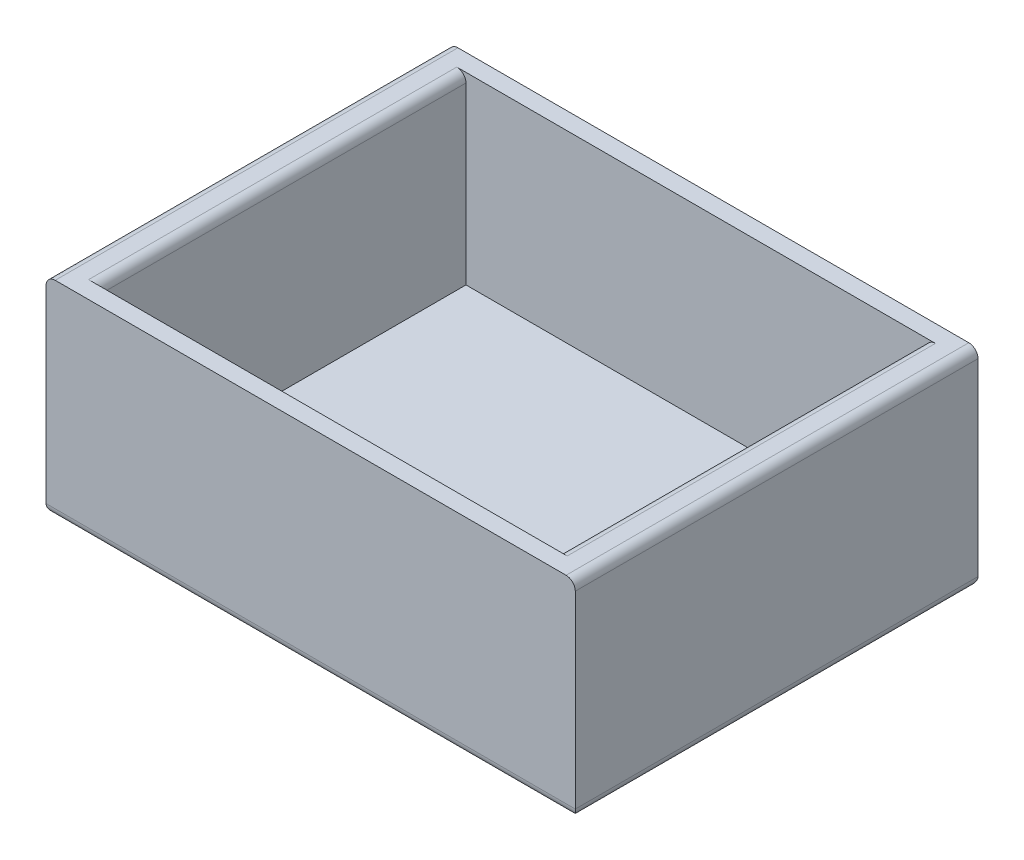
from build123d import *

# Parameters (mm, degrees)
SKETCH1_W           = 146.05
SKETCH1_H           = 111.125
BOSS_EXTRUDE1_DEPTH = 57.15
SKETCH2_W           = 127
SKETCH2_H           = 101.6
CUT_EXTRUDE1_DEPTH  = 50.8
FILLET1_R           = 2.54


with BuildPart() as part:
    # Sketch1 → Boss-Extrude1 (new body)
    with BuildSketch(Plane(origin=(0, 0, 0), x_dir=(1, 0, 0), z_dir=(0, 1, 0))):
        Rectangle(SKETCH1_W, SKETCH1_H)
    extrude(amount=BOSS_EXTRUDE1_DEPTH)

    # Sketch2 → Cut-Extrude1 (cut)
    with BuildSketch(Plane(origin=(0, 57.15, 0), x_dir=(1, 0, 0), z_dir=(0, 1, 0))):
        Rectangle(SKETCH2_W, SKETCH2_H)
    extrude(amount=-CUT_EXTRUDE1_DEPTH, mode=Mode.SUBTRACT)

    # Fillet1
    fillet1_edges = [part.edges().sort_by_distance(p)[0] for p in [
        (-73.025, 57.15, 0),
        (63.5, 57.15, 0),
        (-63.5, 57.15, 0),
        (73.025, 57.15, 0),
        (0, 0, 55.5625),
        (-73.025, 0, 0),
        (0, 0, -55.5625),
        (73.025, 0, 0),
    ]]
    fillet(fillet1_edges, radius=FILLET1_R)


solid = part.part
